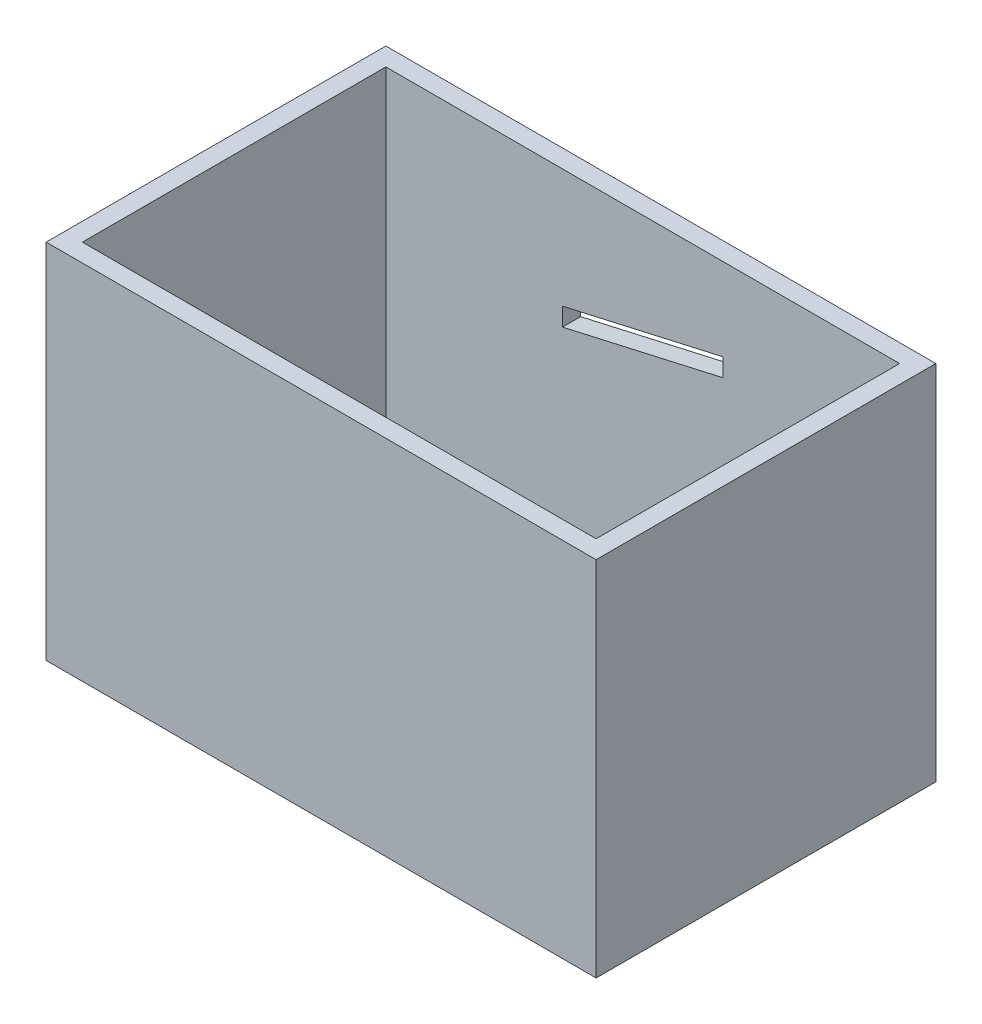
ISO-10303-21;
HEADER;
FILE_DESCRIPTION(('STEP AP214'),'2;1');
FILE_NAME('part.step','',(''),(''),'','','');
FILE_SCHEMA(('AUTOMOTIVE_DESIGN { 1 0 10303 214 1 1 1 1 }'));
ENDSEC;
DATA;
#1=APPLICATION_CONTEXT('core data for automotive mechanical design processes');
#2=APPLICATION_PROTOCOL_DEFINITION('international standard','automotive_design',2000,#1);
#3=PRODUCT_CONTEXT('',#1,'mechanical');
#4=PRODUCT('Part','Part','',(#3));
#5=PRODUCT_RELATED_PRODUCT_CATEGORY('part','',(#4));
#6=PRODUCT_DEFINITION_FORMATION('','',#4);
#7=PRODUCT_DEFINITION_CONTEXT('part definition',#1,'design');
#8=PRODUCT_DEFINITION('design','',#6,#7);
#9=PRODUCT_DEFINITION_SHAPE('','',#8);
#10=(LENGTH_UNIT() NAMED_UNIT(*) SI_UNIT(.MILLI.,.METRE.));
#11=(NAMED_UNIT(*) PLANE_ANGLE_UNIT() SI_UNIT($,.RADIAN.));
#12=(NAMED_UNIT(*) SI_UNIT($,.STERADIAN.) SOLID_ANGLE_UNIT());
#13=UNCERTAINTY_MEASURE_WITH_UNIT(LENGTH_MEASURE(1.E-05),#10,'distance_accuracy_value','');
#14=(GEOMETRIC_REPRESENTATION_CONTEXT(3) GLOBAL_UNCERTAINTY_ASSIGNED_CONTEXT((#13)) GLOBAL_UNIT_ASSIGNED_CONTEXT((#10,
#11,#12)) REPRESENTATION_CONTEXT('',''));
#15=CARTESIAN_POINT('',(0.,0.,0.));
#16=DIRECTION('',(0.,0.,1.));
#17=DIRECTION('',(1.,0.,0.));
#18=AXIS2_PLACEMENT_3D('',#15,#16,#17);
#19=CARTESIAN_POINT('',(-75.9047648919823,100.,-46.8863061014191));
#20=DIRECTION('',(0.,0.,1.));
#21=DIRECTION('',(1.,0.,0.));
#22=AXIS2_PLACEMENT_3D('',#19,#20,#21);
#23=PLANE('',#22);
#24=DIRECTION('',(-1.,0.,0.));
#25=VECTOR('',#24,1.);
#26=CARTESIAN_POINT('',(-75.9047648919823,0.,-46.8863061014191));
#27=LINE('',#26,#25);
#28=CARTESIAN_POINT('',(75.9047648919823,0.,-46.8863061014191));
#29=VERTEX_POINT('',#28);
#30=CARTESIAN_POINT('',(-75.9047648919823,0.,-46.8863061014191));
#31=VERTEX_POINT('',#30);
#32=EDGE_CURVE('E196',#29,#31,#27,.T.);
#33=ORIENTED_EDGE('',*,*,#32,.T.);
#34=DIRECTION('',(0.,-1.,0.));
#35=VECTOR('',#34,1.);
#36=CARTESIAN_POINT('',(-75.9047648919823,100.,-46.8863061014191));
#37=LINE('',#36,#35);
#38=CARTESIAN_POINT('',(-75.9047648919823,100.,-46.8863061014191));
#39=VERTEX_POINT('',#38);
#40=EDGE_CURVE('E206',#39,#31,#37,.T.);
#41=ORIENTED_EDGE('',*,*,#40,.F.);
#42=DIRECTION('',(-1.,0.,0.));
#43=VECTOR('',#42,1.);
#44=CARTESIAN_POINT('',(-75.9047648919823,100.,-46.8863061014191));
#45=LINE('',#44,#43);
#46=CARTESIAN_POINT('',(75.9047648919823,100.,-46.8863061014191));
#47=VERTEX_POINT('',#46);
#48=EDGE_CURVE('E186',#47,#39,#45,.T.);
#49=ORIENTED_EDGE('',*,*,#48,.F.);
#50=DIRECTION('',(0.,-1.,0.));
#51=VECTOR('',#50,1.);
#52=CARTESIAN_POINT('',(75.9047648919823,100.,-46.8863061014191));
#53=LINE('',#52,#51);
#54=EDGE_CURVE('E209',#47,#29,#53,.T.);
#55=ORIENTED_EDGE('',*,*,#54,.T.);
#56=EDGE_LOOP('',(#33,#41,#49,#55));
#57=FACE_BOUND('',#56,.T.);
#58=DIRECTION('',(-0.975267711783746,-0.221026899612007,0.));
#59=VECTOR('',#58,1.);
#60=CARTESIAN_POINT('',(-22.141379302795,67.1845051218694,-46.8863061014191));
#61=LINE('',#60,#59);
#62=CARTESIAN_POINT('',(22.1413793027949,77.2203965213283,-46.8863061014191));
#63=VERTEX_POINT('',#62);
#64=CARTESIAN_POINT('',(-22.141379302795,67.1845051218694,-46.8863061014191));
#65=VERTEX_POINT('',#64);
#66=EDGE_CURVE('E139',#63,#65,#61,.T.);
#67=ORIENTED_EDGE('',*,*,#66,.T.);
#68=DIRECTION('',(0.,-1.,0.));
#69=VECTOR('',#68,1.);
#70=CARTESIAN_POINT('',(-22.141379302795,67.1845051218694,-46.8863061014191));
#71=LINE('',#70,#69);
#72=CARTESIAN_POINT('',(-22.141379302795,62.1845051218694,-46.8863061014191));
#73=VERTEX_POINT('',#72);
#74=EDGE_CURVE('E144',#65,#73,#71,.T.);
#75=ORIENTED_EDGE('',*,*,#74,.T.);
#76=DIRECTION('',(-0.975267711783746,-0.221026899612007,0.));
#77=VECTOR('',#76,1.);
#78=CARTESIAN_POINT('',(-22.141379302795,62.1845051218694,-46.8863061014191));
#79=LINE('',#78,#77);
#80=CARTESIAN_POINT('',(22.1413793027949,72.2203965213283,-46.8863061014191));
#81=VERTEX_POINT('',#80);
#82=EDGE_CURVE('E214',#81,#73,#79,.T.);
#83=ORIENTED_EDGE('',*,*,#82,.F.);
#84=DIRECTION('',(0.,-1.,0.));
#85=VECTOR('',#84,1.);
#86=CARTESIAN_POINT('',(22.1413793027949,77.2203965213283,-46.8863061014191));
#87=LINE('',#86,#85);
#88=EDGE_CURVE('E50',#63,#81,#87,.T.);
#89=ORIENTED_EDGE('',*,*,#88,.F.);
#90=EDGE_LOOP('',(#67,#75,#83,#89));
#91=FACE_BOUND('',#90,.T.);
#92=ADVANCED_FACE('F35',(#57,#91),#23,.F.);
#93=CARTESIAN_POINT('',(0.,100.,0.));
#94=DIRECTION('',(0.,-1.,0.));
#95=DIRECTION('',(0.,0.,-1.));
#96=AXIS2_PLACEMENT_3D('',#93,#94,#95);
#97=PLANE('',#96);
#98=DIRECTION('',(0.,0.,-1.));
#99=VECTOR('',#98,1.);
#100=CARTESIAN_POINT('',(75.9047648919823,100.,46.8863061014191));
#101=LINE('',#100,#99);
#102=CARTESIAN_POINT('',(75.9047648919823,100.,46.8863061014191));
#103=VERTEX_POINT('',#102);
#104=EDGE_CURVE('E183',#103,#47,#101,.T.);
#105=ORIENTED_EDGE('',*,*,#104,.T.);
#106=ORIENTED_EDGE('',*,*,#48,.T.);
#107=DIRECTION('',(0.,0.,1.));
#108=VECTOR('',#107,1.);
#109=CARTESIAN_POINT('',(-75.9047648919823,100.,46.8863061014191));
#110=LINE('',#109,#108);
#111=CARTESIAN_POINT('',(-75.9047648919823,100.,46.8863061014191));
#112=VERTEX_POINT('',#111);
#113=EDGE_CURVE('E189',#39,#112,#110,.T.);
#114=ORIENTED_EDGE('',*,*,#113,.T.);
#115=DIRECTION('',(1.,0.,0.));
#116=VECTOR('',#115,1.);
#117=CARTESIAN_POINT('',(-75.9047648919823,100.,46.8863061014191));
#118=LINE('',#117,#116);
#119=EDGE_CURVE('E191',#112,#103,#118,.T.);
#120=ORIENTED_EDGE('',*,*,#119,.T.);
#121=EDGE_LOOP('',(#105,#106,#114,#120));
#122=FACE_BOUND('',#121,.T.);
#123=DIRECTION('',(0.,0.,1.));
#124=VECTOR('',#123,1.);
#125=CARTESIAN_POINT('',(-70.9047648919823,100.,41.8863061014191));
#126=LINE('',#125,#124);
#127=CARTESIAN_POINT('',(-70.9047648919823,100.,-41.8863061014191));
#128=VERTEX_POINT('',#127);
#129=CARTESIAN_POINT('',(-70.9047648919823,100.,41.8863061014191));
#130=VERTEX_POINT('',#129);
#131=EDGE_CURVE('E154',#128,#130,#126,.T.);
#132=ORIENTED_EDGE('',*,*,#131,.F.);
#133=DIRECTION('',(-1.,0.,0.));
#134=VECTOR('',#133,1.);
#135=CARTESIAN_POINT('',(-70.9047648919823,100.,-41.8863061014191));
#136=LINE('',#135,#134);
#137=CARTESIAN_POINT('',(70.9047648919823,100.,-41.8863061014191));
#138=VERTEX_POINT('',#137);
#139=EDGE_CURVE('E162',#138,#128,#136,.T.);
#140=ORIENTED_EDGE('',*,*,#139,.F.);
#141=DIRECTION('',(0.,0.,-1.));
#142=VECTOR('',#141,1.);
#143=CARTESIAN_POINT('',(70.9047648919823,100.,41.8863061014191));
#144=LINE('',#143,#142);
#145=CARTESIAN_POINT('',(70.9047648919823,100.,41.8863061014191));
#146=VERTEX_POINT('',#145);
#147=EDGE_CURVE('E159',#146,#138,#144,.T.);
#148=ORIENTED_EDGE('',*,*,#147,.F.);
#149=DIRECTION('',(1.,0.,0.));
#150=VECTOR('',#149,1.);
#151=CARTESIAN_POINT('',(-70.9047648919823,100.,41.8863061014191));
#152=LINE('',#151,#150);
#153=EDGE_CURVE('E156',#130,#146,#152,.T.);
#154=ORIENTED_EDGE('',*,*,#153,.F.);
#155=EDGE_LOOP('',(#132,#140,#148,#154));
#156=FACE_BOUND('',#155,.T.);
#157=ADVANCED_FACE('F229',(#122,#156),#97,.F.);
#158=CARTESIAN_POINT('',(0.,0.,0.));
#159=DIRECTION('',(0.,-1.,0.));
#160=DIRECTION('',(0.,0.,-1.));
#161=AXIS2_PLACEMENT_3D('',#158,#159,#160);
#162=PLANE('',#161);
#163=DIRECTION('',(0.,0.,-1.));
#164=VECTOR('',#163,1.);
#165=CARTESIAN_POINT('',(75.9047648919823,0.,46.8863061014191));
#166=LINE('',#165,#164);
#167=CARTESIAN_POINT('',(75.9047648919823,0.,46.8863061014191));
#168=VERTEX_POINT('',#167);
#169=EDGE_CURVE('E182',#168,#29,#166,.T.);
#170=ORIENTED_EDGE('',*,*,#169,.F.);
#171=DIRECTION('',(1.,0.,0.));
#172=VECTOR('',#171,1.);
#173=CARTESIAN_POINT('',(-75.9047648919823,0.,46.8863061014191));
#174=LINE('',#173,#172);
#175=CARTESIAN_POINT('',(-75.9047648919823,0.,46.8863061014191));
#176=VERTEX_POINT('',#175);
#177=EDGE_CURVE('E187',#176,#168,#174,.T.);
#178=ORIENTED_EDGE('',*,*,#177,.F.);
#179=DIRECTION('',(0.,0.,1.));
#180=VECTOR('',#179,1.);
#181=CARTESIAN_POINT('',(-75.9047648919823,0.,46.8863061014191));
#182=LINE('',#181,#180);
#183=EDGE_CURVE('E198',#31,#176,#182,.T.);
#184=ORIENTED_EDGE('',*,*,#183,.F.);
#185=ORIENTED_EDGE('',*,*,#32,.F.);
#186=EDGE_LOOP('',(#170,#178,#184,#185));
#187=FACE_BOUND('',#186,.T.);
#188=DIRECTION('',(-1.,0.,0.));
#189=VECTOR('',#188,1.);
#190=CARTESIAN_POINT('',(-70.9047648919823,0.,-41.8863061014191));
#191=LINE('',#190,#189);
#192=CARTESIAN_POINT('',(70.9047648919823,0.,-41.8863061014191));
#193=VERTEX_POINT('',#192);
#194=CARTESIAN_POINT('',(-70.9047648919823,0.,-41.8863061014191));
#195=VERTEX_POINT('',#194);
#196=EDGE_CURVE('E157',#193,#195,#191,.T.);
#197=ORIENTED_EDGE('',*,*,#196,.T.);
#198=DIRECTION('',(0.,0.,1.));
#199=VECTOR('',#198,1.);
#200=CARTESIAN_POINT('',(-70.9047648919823,0.,41.8863061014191));
#201=LINE('',#200,#199);
#202=CARTESIAN_POINT('',(-70.9047648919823,0.,41.8863061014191));
#203=VERTEX_POINT('',#202);
#204=EDGE_CURVE('E133',#195,#203,#201,.T.);
#205=ORIENTED_EDGE('',*,*,#204,.T.);
#206=DIRECTION('',(1.,0.,0.));
#207=VECTOR('',#206,1.);
#208=CARTESIAN_POINT('',(-70.9047648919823,0.,41.8863061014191));
#209=LINE('',#208,#207);
#210=CARTESIAN_POINT('',(70.9047648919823,0.,41.8863061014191));
#211=VERTEX_POINT('',#210);
#212=EDGE_CURVE('E167',#203,#211,#209,.T.);
#213=ORIENTED_EDGE('',*,*,#212,.T.);
#214=DIRECTION('',(0.,0.,-1.));
#215=VECTOR('',#214,1.);
#216=CARTESIAN_POINT('',(70.9047648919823,0.,41.8863061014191));
#217=LINE('',#216,#215);
#218=EDGE_CURVE('E170',#211,#193,#217,.T.);
#219=ORIENTED_EDGE('',*,*,#218,.T.);
#220=EDGE_LOOP('',(#197,#205,#213,#219));
#221=FACE_BOUND('',#220,.T.);
#222=ADVANCED_FACE('F234',(#187,#221),#162,.T.);
#223=CARTESIAN_POINT('',(75.9047648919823,100.,46.8863061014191));
#224=DIRECTION('',(-1.,0.,0.));
#225=DIRECTION('',(0.,0.,1.));
#226=AXIS2_PLACEMENT_3D('',#223,#224,#225);
#227=PLANE('',#226);
#228=ORIENTED_EDGE('',*,*,#169,.T.);
#229=ORIENTED_EDGE('',*,*,#54,.F.);
#230=ORIENTED_EDGE('',*,*,#104,.F.);
#231=DIRECTION('',(0.,-1.,0.));
#232=VECTOR('',#231,1.);
#233=CARTESIAN_POINT('',(75.9047648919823,100.,46.8863061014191));
#234=LINE('',#233,#232);
#235=EDGE_CURVE('E193',#103,#168,#234,.T.);
#236=ORIENTED_EDGE('',*,*,#235,.T.);
#237=EDGE_LOOP('',(#228,#229,#230,#236));
#238=FACE_BOUND('',#237,.T.);
#239=ADVANCED_FACE('F37',(#238),#227,.F.);
#240=CARTESIAN_POINT('',(-75.9047648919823,100.,46.8863061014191));
#241=DIRECTION('',(1.,0.,0.));
#242=DIRECTION('',(0.,0.,-1.));
#243=AXIS2_PLACEMENT_3D('',#240,#241,#242);
#244=PLANE('',#243);
#245=ORIENTED_EDGE('',*,*,#183,.T.);
#246=DIRECTION('',(0.,-1.,0.));
#247=VECTOR('',#246,1.);
#248=CARTESIAN_POINT('',(-75.9047648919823,100.,46.8863061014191));
#249=LINE('',#248,#247);
#250=EDGE_CURVE('E203',#112,#176,#249,.T.);
#251=ORIENTED_EDGE('',*,*,#250,.F.);
#252=ORIENTED_EDGE('',*,*,#113,.F.);
#253=ORIENTED_EDGE('',*,*,#40,.T.);
#254=EDGE_LOOP('',(#245,#251,#252,#253));
#255=FACE_BOUND('',#254,.T.);
#256=ADVANCED_FACE('F238',(#255),#244,.F.);
#257=CARTESIAN_POINT('',(-75.9047648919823,100.,46.8863061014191));
#258=DIRECTION('',(0.,0.,-1.));
#259=DIRECTION('',(-1.,0.,0.));
#260=AXIS2_PLACEMENT_3D('',#257,#258,#259);
#261=PLANE('',#260);
#262=ORIENTED_EDGE('',*,*,#177,.T.);
#263=ORIENTED_EDGE('',*,*,#235,.F.);
#264=ORIENTED_EDGE('',*,*,#119,.F.);
#265=ORIENTED_EDGE('',*,*,#250,.T.);
#266=EDGE_LOOP('',(#262,#263,#264,#265));
#267=FACE_BOUND('',#266,.T.);
#268=ADVANCED_FACE('F241',(#267),#261,.F.);
#269=CARTESIAN_POINT('',(-70.9047648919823,100.,41.8863061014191));
#270=DIRECTION('',(1.,0.,0.));
#271=DIRECTION('',(0.,0.,-1.));
#272=AXIS2_PLACEMENT_3D('',#269,#270,#271);
#273=PLANE('',#272);
#274=ORIENTED_EDGE('',*,*,#204,.F.);
#275=DIRECTION('',(0.,-1.,0.));
#276=VECTOR('',#275,1.);
#277=CARTESIAN_POINT('',(-70.9047648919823,100.,-41.8863061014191));
#278=LINE('',#277,#276);
#279=EDGE_CURVE('E164',#128,#195,#278,.T.);
#280=ORIENTED_EDGE('',*,*,#279,.F.);
#281=ORIENTED_EDGE('',*,*,#131,.T.);
#282=DIRECTION('',(0.,-1.,0.));
#283=VECTOR('',#282,1.);
#284=CARTESIAN_POINT('',(-70.9047648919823,100.,41.8863061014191));
#285=LINE('',#284,#283);
#286=EDGE_CURVE('E180',#130,#203,#285,.T.);
#287=ORIENTED_EDGE('',*,*,#286,.T.);
#288=EDGE_LOOP('',(#274,#280,#281,#287));
#289=FACE_BOUND('',#288,.T.);
#290=ADVANCED_FACE('F245',(#289),#273,.T.);
#291=CARTESIAN_POINT('',(-70.9047648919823,100.,41.8863061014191));
#292=DIRECTION('',(0.,0.,-1.));
#293=DIRECTION('',(-1.,0.,0.));
#294=AXIS2_PLACEMENT_3D('',#291,#292,#293);
#295=PLANE('',#294);
#296=ORIENTED_EDGE('',*,*,#212,.F.);
#297=ORIENTED_EDGE('',*,*,#286,.F.);
#298=ORIENTED_EDGE('',*,*,#153,.T.);
#299=DIRECTION('',(0.,-1.,0.));
#300=VECTOR('',#299,1.);
#301=CARTESIAN_POINT('',(70.9047648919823,100.,41.8863061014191));
#302=LINE('',#301,#300);
#303=EDGE_CURVE('E178',#146,#211,#302,.T.);
#304=ORIENTED_EDGE('',*,*,#303,.T.);
#305=EDGE_LOOP('',(#296,#297,#298,#304));
#306=FACE_BOUND('',#305,.T.);
#307=ADVANCED_FACE('F252',(#306),#295,.T.);
#308=CARTESIAN_POINT('',(70.9047648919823,100.,41.8863061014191));
#309=DIRECTION('',(-1.,0.,0.));
#310=DIRECTION('',(0.,0.,1.));
#311=AXIS2_PLACEMENT_3D('',#308,#309,#310);
#312=PLANE('',#311);
#313=ORIENTED_EDGE('',*,*,#218,.F.);
#314=ORIENTED_EDGE('',*,*,#303,.F.);
#315=ORIENTED_EDGE('',*,*,#147,.T.);
#316=DIRECTION('',(0.,-1.,0.));
#317=VECTOR('',#316,1.);
#318=CARTESIAN_POINT('',(70.9047648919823,100.,-41.8863061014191));
#319=LINE('',#318,#317);
#320=EDGE_CURVE('E176',#138,#193,#319,.T.);
#321=ORIENTED_EDGE('',*,*,#320,.T.);
#322=EDGE_LOOP('',(#313,#314,#315,#321));
#323=FACE_BOUND('',#322,.T.);
#324=ADVANCED_FACE('F256',(#323),#312,.T.);
#325=CARTESIAN_POINT('',(-70.9047648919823,100.,-41.8863061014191));
#326=DIRECTION('',(0.,0.,1.));
#327=DIRECTION('',(1.,0.,0.));
#328=AXIS2_PLACEMENT_3D('',#325,#326,#327);
#329=PLANE('',#328);
#330=DIRECTION('',(0.,-1.,0.));
#331=VECTOR('',#330,1.);
#332=CARTESIAN_POINT('',(-22.141379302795,67.1845051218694,-41.8863061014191));
#333=LINE('',#332,#331);
#334=CARTESIAN_POINT('',(-22.141379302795,67.1845051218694,-41.8863061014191));
#335=VERTEX_POINT('',#334);
#336=CARTESIAN_POINT('',(-22.141379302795,62.1845051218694,-41.8863061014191));
#337=VERTEX_POINT('',#336);
#338=EDGE_CURVE('E58',#335,#337,#333,.T.);
#339=ORIENTED_EDGE('',*,*,#338,.F.);
#340=DIRECTION('',(0.975267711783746,0.221026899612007,0.));
#341=VECTOR('',#340,1.);
#342=CARTESIAN_POINT('',(-61.4488114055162,58.2761820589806,-41.8863061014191));
#343=LINE('',#342,#341);
#344=CARTESIAN_POINT('',(22.1413793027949,77.2203965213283,-41.8863061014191));
#345=VERTEX_POINT('',#344);
#346=EDGE_CURVE('E11',#335,#345,#343,.T.);
#347=ORIENTED_EDGE('',*,*,#346,.T.);
#348=DIRECTION('',(0.,-1.,0.));
#349=VECTOR('',#348,1.);
#350=CARTESIAN_POINT('',(22.1413793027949,77.2203965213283,-41.8863061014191));
#351=LINE('',#350,#349);
#352=CARTESIAN_POINT('',(22.1413793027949,72.2203965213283,-41.8863061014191));
#353=VERTEX_POINT('',#352);
#354=EDGE_CURVE('E125',#345,#353,#351,.T.);
#355=ORIENTED_EDGE('',*,*,#354,.T.);
#356=DIRECTION('',(0.975267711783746,0.221026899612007,0.));
#357=VECTOR('',#356,1.);
#358=CARTESIAN_POINT('',(-60.3710094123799,53.5204465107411,-41.8863061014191));
#359=LINE('',#358,#357);
#360=EDGE_CURVE('E43',#337,#353,#359,.T.);
#361=ORIENTED_EDGE('',*,*,#360,.F.);
#362=EDGE_LOOP('',(#339,#347,#355,#361));
#363=FACE_BOUND('',#362,.T.);
#364=ORIENTED_EDGE('',*,*,#279,.T.);
#365=ORIENTED_EDGE('',*,*,#196,.F.);
#366=ORIENTED_EDGE('',*,*,#320,.F.);
#367=ORIENTED_EDGE('',*,*,#139,.T.);
#368=EDGE_LOOP('',(#364,#365,#366,#367));
#369=FACE_BOUND('',#368,.T.);
#370=ADVANCED_FACE('F142',(#363,#369),#329,.T.);
#371=CARTESIAN_POINT('',(22.1413793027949,77.2203965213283,-46.8863061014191));
#372=DIRECTION('',(-1.,0.,0.));
#373=DIRECTION('',(0.,0.,1.));
#374=AXIS2_PLACEMENT_3D('',#371,#372,#373);
#375=PLANE('',#374);
#376=DIRECTION('',(0.,0.,-1.));
#377=VECTOR('',#376,1.);
#378=CARTESIAN_POINT('',(22.1413793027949,72.2203965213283,-46.8863061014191));
#379=LINE('',#378,#377);
#380=EDGE_CURVE('E130',#353,#81,#379,.T.);
#381=ORIENTED_EDGE('',*,*,#380,.F.);
#382=ORIENTED_EDGE('',*,*,#354,.F.);
#383=DIRECTION('',(0.,0.,-1.));
#384=VECTOR('',#383,1.);
#385=CARTESIAN_POINT('',(22.1413793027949,77.2203965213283,-46.8863061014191));
#386=LINE('',#385,#384);
#387=EDGE_CURVE('E128',#345,#63,#386,.T.);
#388=ORIENTED_EDGE('',*,*,#387,.T.);
#389=ORIENTED_EDGE('',*,*,#88,.T.);
#390=EDGE_LOOP('',(#381,#382,#388,#389));
#391=FACE_BOUND('',#390,.T.);
#392=ADVANCED_FACE('F127',(#391),#375,.T.);
#393=CARTESIAN_POINT('',(-22.141379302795,67.1845051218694,-41.8863061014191));
#394=DIRECTION('',(1.,0.,0.));
#395=DIRECTION('',(0.,0.,-1.));
#396=AXIS2_PLACEMENT_3D('',#393,#394,#395);
#397=PLANE('',#396);
#398=DIRECTION('',(0.,0.,1.));
#399=VECTOR('',#398,1.);
#400=CARTESIAN_POINT('',(-22.141379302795,62.1845051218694,-41.8863061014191));
#401=LINE('',#400,#399);
#402=EDGE_CURVE('E140',#73,#337,#401,.T.);
#403=ORIENTED_EDGE('',*,*,#402,.F.);
#404=ORIENTED_EDGE('',*,*,#74,.F.);
#405=DIRECTION('',(0.,0.,1.));
#406=VECTOR('',#405,1.);
#407=CARTESIAN_POINT('',(-22.141379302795,67.1845051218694,-41.8863061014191));
#408=LINE('',#407,#406);
#409=EDGE_CURVE('E145',#65,#335,#408,.T.);
#410=ORIENTED_EDGE('',*,*,#409,.T.);
#411=ORIENTED_EDGE('',*,*,#338,.T.);
#412=EDGE_LOOP('',(#403,#404,#410,#411));
#413=FACE_BOUND('',#412,.T.);
#414=ADVANCED_FACE('F218',(#413),#397,.T.);
#415=CARTESIAN_POINT('',(-14.4861870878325,68.9194168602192,0.));
#416=DIRECTION('',(0.221026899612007,-0.975267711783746,0.));
#417=DIRECTION('',(0.975267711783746,0.221026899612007,0.));
#418=AXIS2_PLACEMENT_3D('',#415,#416,#417);
#419=PLANE('',#418);
#420=ORIENTED_EDGE('',*,*,#409,.F.);
#421=ORIENTED_EDGE('',*,*,#66,.F.);
#422=ORIENTED_EDGE('',*,*,#387,.F.);
#423=ORIENTED_EDGE('',*,*,#346,.F.);
#424=EDGE_LOOP('',(#420,#421,#422,#423));
#425=FACE_BOUND('',#424,.T.);
#426=ADVANCED_FACE('F137',(#425),#419,.T.);
#427=CARTESIAN_POINT('',(-14.4861870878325,63.9194168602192,0.));
#428=DIRECTION('',(0.221026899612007,-0.975267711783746,0.));
#429=DIRECTION('',(0.975267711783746,0.221026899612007,0.));
#430=AXIS2_PLACEMENT_3D('',#427,#428,#429);
#431=PLANE('',#430);
#432=ORIENTED_EDGE('',*,*,#360,.T.);
#433=ORIENTED_EDGE('',*,*,#380,.T.);
#434=ORIENTED_EDGE('',*,*,#82,.T.);
#435=ORIENTED_EDGE('',*,*,#402,.T.);
#436=EDGE_LOOP('',(#432,#433,#434,#435));
#437=FACE_BOUND('',#436,.T.);
#438=ADVANCED_FACE('F212',(#437),#431,.F.);
#439=CLOSED_SHELL('',(#92,#157,#222,#239,#256,#268,#290,#307,#324,#370,#392,#414,#426,#438));
#440=MANIFOLD_SOLID_BREP('B2',#439);
#441=ADVANCED_BREP_SHAPE_REPRESENTATION('',(#18,#440),#14);
#442=SHAPE_DEFINITION_REPRESENTATION(#9,#441);
ENDSEC;
END-ISO-10303-21;
